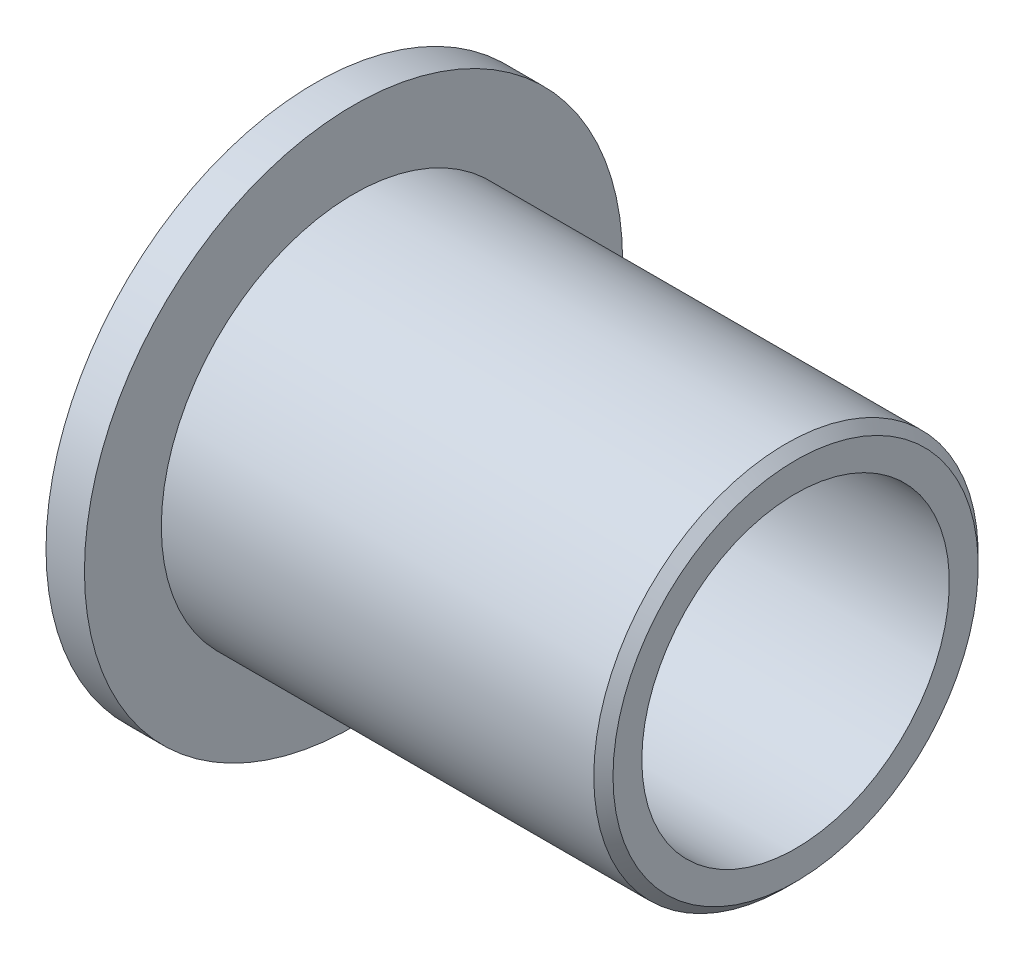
ISO-10303-21;
HEADER;
FILE_DESCRIPTION(('STEP AP214'),'2;1');
FILE_NAME('part.step','',(''),(''),'','','');
FILE_SCHEMA(('AUTOMOTIVE_DESIGN { 1 0 10303 214 1 1 1 1 }'));
ENDSEC;
DATA;
#1=APPLICATION_CONTEXT('core data for automotive mechanical design processes');
#2=APPLICATION_PROTOCOL_DEFINITION('international standard','automotive_design',2000,#1);
#3=PRODUCT_CONTEXT('',#1,'mechanical');
#4=PRODUCT('Part','Part','',(#3));
#5=PRODUCT_RELATED_PRODUCT_CATEGORY('part','',(#4));
#6=PRODUCT_DEFINITION_FORMATION('','',#4);
#7=PRODUCT_DEFINITION_CONTEXT('part definition',#1,'design');
#8=PRODUCT_DEFINITION('design','',#6,#7);
#9=PRODUCT_DEFINITION_SHAPE('','',#8);
#10=(LENGTH_UNIT() NAMED_UNIT(*) SI_UNIT(.MILLI.,.METRE.));
#11=(NAMED_UNIT(*) PLANE_ANGLE_UNIT() SI_UNIT($,.RADIAN.));
#12=(NAMED_UNIT(*) SI_UNIT($,.STERADIAN.) SOLID_ANGLE_UNIT());
#13=UNCERTAINTY_MEASURE_WITH_UNIT(LENGTH_MEASURE(1.E-05),#10,'distance_accuracy_value','');
#14=(GEOMETRIC_REPRESENTATION_CONTEXT(3) GLOBAL_UNCERTAINTY_ASSIGNED_CONTEXT((#13)) GLOBAL_UNIT_ASSIGNED_CONTEXT((#10,
#11,#12)) REPRESENTATION_CONTEXT('',''));
#15=CARTESIAN_POINT('',(0.,0.,0.));
#16=DIRECTION('',(0.,0.,1.));
#17=DIRECTION('',(1.,0.,0.));
#18=AXIS2_PLACEMENT_3D('',#15,#16,#17);
#19=CARTESIAN_POINT('',(0.,14.,0.));
#20=DIRECTION('',(1.,0.,0.));
#21=DIRECTION('',(0.,0.,-1.));
#22=AXIS2_PLACEMENT_3D('',#19,#20,#21);
#23=PLANE('',#22);
#24=CARTESIAN_POINT('',(0.,0.,0.));
#25=DIRECTION('',(-1.,0.,0.));
#26=DIRECTION('',(0.,0.,1.));
#27=AXIS2_PLACEMENT_3D('',#24,#25,#26);
#28=CIRCLE('',#27,8.);
#29=CARTESIAN_POINT('',(0.,0.,8.));
#30=VERTEX_POINT('',#29);
#31=EDGE_CURVE('E41',#30,#30,#28,.T.);
#32=ORIENTED_EDGE('',*,*,#31,.F.);
#33=EDGE_LOOP('',(#32));
#34=FACE_BOUND('',#33,.T.);
#35=CARTESIAN_POINT('',(0.,0.,0.));
#36=DIRECTION('',(-1.,0.,0.));
#37=DIRECTION('',(0.,0.,1.));
#38=AXIS2_PLACEMENT_3D('',#35,#36,#37);
#39=CIRCLE('',#38,14.);
#40=CARTESIAN_POINT('',(0.,0.,14.));
#41=VERTEX_POINT('',#40);
#42=EDGE_CURVE('E56',#41,#41,#39,.T.);
#43=ORIENTED_EDGE('',*,*,#42,.T.);
#44=EDGE_LOOP('',(#43));
#45=FACE_BOUND('',#44,.T.);
#46=ADVANCED_FACE('F30',(#34,#45),#23,.F.);
#47=CARTESIAN_POINT('',(0.,0.,0.));
#48=DIRECTION('',(-1.,0.,0.));
#49=DIRECTION('',(0.,0.,1.));
#50=AXIS2_PLACEMENT_3D('',#47,#48,#49);
#51=CYLINDRICAL_SURFACE('',#50,8.);
#52=CARTESIAN_POINT('',(25.,0.,0.));
#53=DIRECTION('',(-1.,0.,0.));
#54=DIRECTION('',(0.,0.,1.));
#55=AXIS2_PLACEMENT_3D('',#52,#53,#54);
#56=CIRCLE('',#55,8.);
#57=CARTESIAN_POINT('',(25.,0.,8.));
#58=VERTEX_POINT('',#57);
#59=EDGE_CURVE('E45',#58,#58,#56,.T.);
#60=ORIENTED_EDGE('',*,*,#59,.F.);
#61=EDGE_LOOP('',(#60));
#62=FACE_BOUND('',#61,.T.);
#63=ORIENTED_EDGE('',*,*,#31,.T.);
#64=EDGE_LOOP('',(#63));
#65=FACE_BOUND('',#64,.T.);
#66=ADVANCED_FACE('F80',(#62,#65),#51,.F.);
#67=CARTESIAN_POINT('',(25.,10.,0.));
#68=DIRECTION('',(-1.,0.,0.));
#69=DIRECTION('',(0.,0.,1.));
#70=AXIS2_PLACEMENT_3D('',#67,#68,#69);
#71=PLANE('',#70);
#72=CARTESIAN_POINT('',(25.,0.,0.));
#73=DIRECTION('',(-1.,0.,0.));
#74=DIRECTION('',(0.,0.,1.));
#75=AXIS2_PLACEMENT_3D('',#72,#73,#74);
#76=CIRCLE('',#75,9.50000000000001);
#77=CARTESIAN_POINT('',(25.,0.,9.50000000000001));
#78=VERTEX_POINT('',#77);
#79=EDGE_CURVE('E10',#78,#78,#76,.F.);
#80=ORIENTED_EDGE('',*,*,#79,.T.);
#81=EDGE_LOOP('',(#80));
#82=FACE_BOUND('',#81,.T.);
#83=ORIENTED_EDGE('',*,*,#59,.T.);
#84=EDGE_LOOP('',(#83));
#85=FACE_BOUND('',#84,.T.);
#86=ADVANCED_FACE('F75',(#82,#85),#71,.F.);
#87=CARTESIAN_POINT('',(0.,0.,0.));
#88=DIRECTION('',(-1.,0.,0.));
#89=DIRECTION('',(0.,0.,1.));
#90=AXIS2_PLACEMENT_3D('',#87,#88,#89);
#91=CYLINDRICAL_SURFACE('',#90,10.);
#92=CARTESIAN_POINT('',(24.5,0.,0.));
#93=DIRECTION('',(-1.,0.,0.));
#94=DIRECTION('',(0.,0.,1.));
#95=AXIS2_PLACEMENT_3D('',#92,#93,#94);
#96=CIRCLE('',#95,10.);
#97=CARTESIAN_POINT('',(24.5,0.,10.));
#98=VERTEX_POINT('',#97);
#99=EDGE_CURVE('E37',#98,#98,#96,.T.);
#100=ORIENTED_EDGE('',*,*,#99,.T.);
#101=EDGE_LOOP('',(#100));
#102=FACE_BOUND('',#101,.T.);
#103=CARTESIAN_POINT('',(2.,0.,0.));
#104=DIRECTION('',(-1.,0.,0.));
#105=DIRECTION('',(0.,0.,1.));
#106=AXIS2_PLACEMENT_3D('',#103,#104,#105);
#107=CIRCLE('',#106,10.);
#108=CARTESIAN_POINT('',(2.,0.,10.));
#109=VERTEX_POINT('',#108);
#110=EDGE_CURVE('E50',#109,#109,#107,.T.);
#111=ORIENTED_EDGE('',*,*,#110,.F.);
#112=EDGE_LOOP('',(#111));
#113=FACE_BOUND('',#112,.T.);
#114=ADVANCED_FACE('F70',(#102,#113),#91,.T.);
#115=CARTESIAN_POINT('',(2.,14.,0.));
#116=DIRECTION('',(-1.,0.,0.));
#117=DIRECTION('',(0.,0.,1.));
#118=AXIS2_PLACEMENT_3D('',#115,#116,#117);
#119=PLANE('',#118);
#120=CARTESIAN_POINT('',(2.,0.,0.));
#121=DIRECTION('',(-1.,0.,0.));
#122=DIRECTION('',(0.,0.,1.));
#123=AXIS2_PLACEMENT_3D('',#120,#121,#122);
#124=CIRCLE('',#123,14.);
#125=CARTESIAN_POINT('',(2.,0.,14.));
#126=VERTEX_POINT('',#125);
#127=EDGE_CURVE('E53',#126,#126,#124,.T.);
#128=ORIENTED_EDGE('',*,*,#127,.F.);
#129=EDGE_LOOP('',(#128));
#130=FACE_BOUND('',#129,.T.);
#131=ORIENTED_EDGE('',*,*,#110,.T.);
#132=EDGE_LOOP('',(#131));
#133=FACE_BOUND('',#132,.T.);
#134=ADVANCED_FACE('F64',(#130,#133),#119,.F.);
#135=CARTESIAN_POINT('',(0.,0.,0.));
#136=DIRECTION('',(-1.,0.,0.));
#137=DIRECTION('',(0.,0.,1.));
#138=AXIS2_PLACEMENT_3D('',#135,#136,#137);
#139=CYLINDRICAL_SURFACE('',#138,14.);
#140=ORIENTED_EDGE('',*,*,#42,.F.);
#141=EDGE_LOOP('',(#140));
#142=FACE_BOUND('',#141,.T.);
#143=ORIENTED_EDGE('',*,*,#127,.T.);
#144=EDGE_LOOP('',(#143));
#145=FACE_BOUND('',#144,.T.);
#146=ADVANCED_FACE('F61',(#142,#145),#139,.T.);
#147=CARTESIAN_POINT('',(24.5,0.,0.));
#148=DIRECTION('',(-1.,0.,0.));
#149=DIRECTION('',(0.,0.,1.));
#150=AXIS2_PLACEMENT_3D('',#147,#148,#149);
#151=CONICAL_SURFACE('',#150,10.,0.78539816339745);
#152=ORIENTED_EDGE('',*,*,#79,.F.);
#153=EDGE_LOOP('',(#152));
#154=FACE_BOUND('',#153,.T.);
#155=ORIENTED_EDGE('',*,*,#99,.F.);
#156=EDGE_LOOP('',(#155));
#157=FACE_BOUND('',#156,.T.);
#158=ADVANCED_FACE('F32',(#154,#157),#151,.T.);
#159=CLOSED_SHELL('',(#46,#66,#86,#114,#134,#146,#158));
#160=MANIFOLD_SOLID_BREP('B2',#159);
#161=ADVANCED_BREP_SHAPE_REPRESENTATION('',(#18,#160),#14);
#162=SHAPE_DEFINITION_REPRESENTATION(#9,#161);
ENDSEC;
END-ISO-10303-21;
